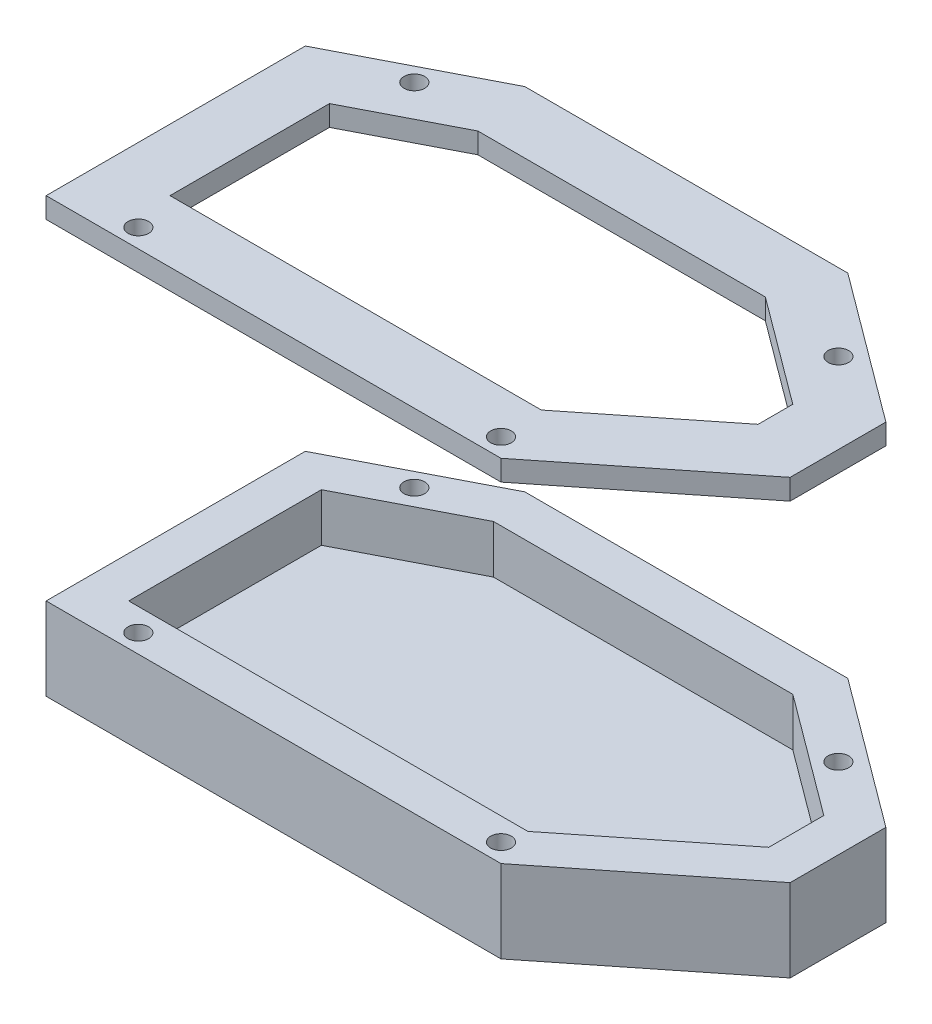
ISO-10303-21;
HEADER;
FILE_DESCRIPTION(('STEP AP214'),'2;1');
FILE_NAME('part.step','',(''),(''),'','','');
FILE_SCHEMA(('AUTOMOTIVE_DESIGN { 1 0 10303 214 1 1 1 1 }'));
ENDSEC;
DATA;
#1=APPLICATION_CONTEXT('core data for automotive mechanical design processes');
#2=APPLICATION_PROTOCOL_DEFINITION('international standard','automotive_design',2000,#1);
#3=PRODUCT_CONTEXT('',#1,'mechanical');
#4=PRODUCT('Part','Part','',(#3));
#5=PRODUCT_RELATED_PRODUCT_CATEGORY('part','',(#4));
#6=PRODUCT_DEFINITION_FORMATION('','',#4);
#7=PRODUCT_DEFINITION_CONTEXT('part definition',#1,'design');
#8=PRODUCT_DEFINITION('design','',#6,#7);
#9=PRODUCT_DEFINITION_SHAPE('','',#8);
#10=(LENGTH_UNIT() NAMED_UNIT(*) SI_UNIT(.MILLI.,.METRE.));
#11=(NAMED_UNIT(*) PLANE_ANGLE_UNIT() SI_UNIT($,.RADIAN.));
#12=(NAMED_UNIT(*) SI_UNIT($,.STERADIAN.) SOLID_ANGLE_UNIT());
#13=UNCERTAINTY_MEASURE_WITH_UNIT(LENGTH_MEASURE(1.E-05),#10,'distance_accuracy_value','');
#14=(GEOMETRIC_REPRESENTATION_CONTEXT(3) GLOBAL_UNCERTAINTY_ASSIGNED_CONTEXT((#13)) GLOBAL_UNIT_ASSIGNED_CONTEXT((#10,
#11,#12)) REPRESENTATION_CONTEXT('',''));
#15=CARTESIAN_POINT('',(0.,0.,0.));
#16=DIRECTION('',(0.,0.,1.));
#17=DIRECTION('',(1.,0.,0.));
#18=AXIS2_PLACEMENT_3D('',#15,#16,#17);
#19=CARTESIAN_POINT('',(0.,63.,0.));
#20=DIRECTION('',(0.,-1.,0.));
#21=DIRECTION('',(0.,0.,-1.));
#22=AXIS2_PLACEMENT_3D('',#19,#20,#21);
#23=PLANE('',#22);
#24=CARTESIAN_POINT('',(71.8,63.,-31.3172214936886));
#25=DIRECTION('',(0.,1.,0.));
#26=DIRECTION('',(0.,0.,1.));
#27=AXIS2_PLACEMENT_3D('',#24,#25,#26);
#28=CIRCLE('',#27,1.5);
#29=CARTESIAN_POINT('',(71.8,63.,-29.8172214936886));
#30=VERTEX_POINT('',#29);
#31=EDGE_CURVE('E214',#30,#30,#28,.T.);
#32=ORIENTED_EDGE('',*,*,#31,.F.);
#33=EDGE_LOOP('',(#32));
#34=FACE_BOUND('',#33,.T.);
#35=CARTESIAN_POINT('',(57.3941306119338,63.,3.3));
#36=DIRECTION('',(0.,1.,0.));
#37=DIRECTION('',(0.,0.,1.));
#38=AXIS2_PLACEMENT_3D('',#35,#36,#37);
#39=CIRCLE('',#38,1.5);
#40=CARTESIAN_POINT('',(57.3941306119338,63.,4.8));
#41=VERTEX_POINT('',#40);
#42=EDGE_CURVE('E220',#41,#41,#39,.T.);
#43=ORIENTED_EDGE('',*,*,#42,.F.);
#44=EDGE_LOOP('',(#43));
#45=FACE_BOUND('',#44,.T.);
#46=CARTESIAN_POINT('',(4.7,63.,3.3));
#47=DIRECTION('',(0.,1.,0.));
#48=DIRECTION('',(0.,0.,1.));
#49=AXIS2_PLACEMENT_3D('',#46,#47,#48);
#50=CIRCLE('',#49,1.5);
#51=CARTESIAN_POINT('',(4.7,63.,4.8));
#52=VERTEX_POINT('',#51);
#53=EDGE_CURVE('E226',#52,#52,#50,.T.);
#54=ORIENTED_EDGE('',*,*,#53,.F.);
#55=EDGE_LOOP('',(#54));
#56=FACE_BOUND('',#55,.T.);
#57=CARTESIAN_POINT('',(6.5,63.,-35.));
#58=DIRECTION('',(0.,1.,0.));
#59=DIRECTION('',(0.,0.,1.));
#60=AXIS2_PLACEMENT_3D('',#57,#58,#59);
#61=CIRCLE('',#60,1.5);
#62=CARTESIAN_POINT('',(6.5,63.,-33.5));
#63=VERTEX_POINT('',#62);
#64=EDGE_CURVE('E232',#63,#63,#61,.T.);
#65=ORIENTED_EDGE('',*,*,#64,.F.);
#66=EDGE_LOOP('',(#65));
#67=FACE_BOUND('',#66,.T.);
#68=DIRECTION('',(-0.888974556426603,0.,0.457956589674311));
#69=VECTOR('',#68,1.);
#70=CARTESIAN_POINT('',(15.0453803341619,63.,-42.5));
#71=LINE('',#70,#69);
#72=CARTESIAN_POINT('',(15.0453803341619,63.,-42.5));
#73=VERTEX_POINT('',#72);
#74=CARTESIAN_POINT('',(-6.,63.,-31.6584404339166));
#75=VERTEX_POINT('',#74);
#76=EDGE_CURVE('E238',#73,#75,#71,.T.);
#77=ORIENTED_EDGE('',*,*,#76,.T.);
#78=DIRECTION('',(0.,0.,1.));
#79=VECTOR('',#78,1.);
#80=CARTESIAN_POINT('',(-6.,63.,-31.6584404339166));
#81=LINE('',#80,#79);
#82=CARTESIAN_POINT('',(-6.,63.,6.));
#83=VERTEX_POINT('',#82);
#84=EDGE_CURVE('E241',#75,#83,#81,.T.);
#85=ORIENTED_EDGE('',*,*,#84,.T.);
#86=DIRECTION('',(1.,0.,0.));
#87=VECTOR('',#86,1.);
#88=CARTESIAN_POINT('',(-6.,63.,6.));
#89=LINE('',#88,#87);
#90=CARTESIAN_POINT('',(60.0941306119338,63.,6.));
#91=VERTEX_POINT('',#90);
#92=EDGE_CURVE('E244',#83,#91,#89,.T.);
#93=ORIENTED_EDGE('',*,*,#92,.T.);
#94=DIRECTION('',(0.782823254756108,0.,-0.622244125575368));
#95=VECTOR('',#94,1.);
#96=CARTESIAN_POINT('',(60.0941306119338,63.,6.));
#97=LINE('',#96,#95);
#98=CARTESIAN_POINT('',(83.5,63.,-12.604665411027));
#99=VERTEX_POINT('',#98);
#100=EDGE_CURVE('E246',#91,#99,#97,.T.);
#101=ORIENTED_EDGE('',*,*,#100,.T.);
#102=DIRECTION('',(0.,0.,-1.));
#103=VECTOR('',#102,1.);
#104=CARTESIAN_POINT('',(83.5,63.,-12.604665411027));
#105=LINE('',#104,#103);
#106=CARTESIAN_POINT('',(83.5,63.,-26.5172214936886));
#107=VERTEX_POINT('',#106);
#108=EDGE_CURVE('E248',#99,#107,#105,.T.);
#109=ORIENTED_EDGE('',*,*,#108,.T.);
#110=DIRECTION('',(-0.802743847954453,0.,-0.596324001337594));
#111=VECTOR('',#110,1.);
#112=CARTESIAN_POINT('',(83.5,63.,-26.5172214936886));
#113=LINE('',#112,#111);
#114=CARTESIAN_POINT('',(61.9847212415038,63.,-42.5));
#115=VERTEX_POINT('',#114);
#116=EDGE_CURVE('E250',#107,#115,#113,.T.);
#117=ORIENTED_EDGE('',*,*,#116,.T.);
#118=DIRECTION('',(-1.,0.,0.));
#119=VECTOR('',#118,1.);
#120=CARTESIAN_POINT('',(61.9847212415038,63.,-42.5));
#121=LINE('',#120,#119);
#122=EDGE_CURVE('E252',#115,#73,#121,.T.);
#123=ORIENTED_EDGE('',*,*,#122,.T.);
#124=EDGE_LOOP('',(#77,#85,#93,#101,#109,#117,#123));
#125=FACE_BOUND('',#124,.T.);
#126=DIRECTION('',(-0.888974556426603,0.,0.457956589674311));
#127=VECTOR('',#126,1.);
#128=CARTESIAN_POINT('',(17.227309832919,63.,-33.5));
#129=LINE('',#128,#127);
#130=CARTESIAN_POINT('',(17.227309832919,63.,-33.5));
#131=VERTEX_POINT('',#130);
#132=CARTESIAN_POINT('',(3.,63.,-26.1707797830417));
#133=VERTEX_POINT('',#132);
#134=EDGE_CURVE('E156',#131,#133,#129,.T.);
#135=ORIENTED_EDGE('',*,*,#134,.F.);
#136=DIRECTION('',(-1.,0.,0.));
#137=VECTOR('',#136,1.);
#138=CARTESIAN_POINT('',(59.0076393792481,63.,-33.5));
#139=LINE('',#138,#137);
#140=CARTESIAN_POINT('',(59.0076393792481,63.,-33.5));
#141=VERTEX_POINT('',#140);
#142=EDGE_CURVE('E187',#141,#131,#139,.T.);
#143=ORIENTED_EDGE('',*,*,#142,.F.);
#144=DIRECTION('',(-0.802743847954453,0.,-0.596324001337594));
#145=VECTOR('',#144,1.);
#146=CARTESIAN_POINT('',(74.5,63.,-21.9913892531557));
#147=LINE('',#146,#145);
#148=CARTESIAN_POINT('',(74.5,63.,-21.9913892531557));
#149=VERTEX_POINT('',#148);
#150=EDGE_CURVE('E185',#149,#141,#147,.T.);
#151=ORIENTED_EDGE('',*,*,#150,.F.);
#152=DIRECTION('',(0.,0.,-1.));
#153=VECTOR('',#152,1.);
#154=CARTESIAN_POINT('',(74.5,63.,-16.9476672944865));
#155=LINE('',#154,#153);
#156=CARTESIAN_POINT('',(74.5,63.,-16.9476672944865));
#157=VERTEX_POINT('',#156);
#158=EDGE_CURVE('E183',#157,#149,#155,.T.);
#159=ORIENTED_EDGE('',*,*,#158,.F.);
#160=DIRECTION('',(0.782823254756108,0.,-0.622244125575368));
#161=VECTOR('',#160,1.);
#162=CARTESIAN_POINT('',(56.9529346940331,63.,-3.));
#163=LINE('',#162,#161);
#164=CARTESIAN_POINT('',(56.9529346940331,63.,-3.));
#165=VERTEX_POINT('',#164);
#166=EDGE_CURVE('E179',#165,#157,#163,.T.);
#167=ORIENTED_EDGE('',*,*,#166,.F.);
#168=DIRECTION('',(1.,0.,0.));
#169=VECTOR('',#168,1.);
#170=CARTESIAN_POINT('',(3.,63.,-3.));
#171=LINE('',#170,#169);
#172=CARTESIAN_POINT('',(3.,63.,-3.));
#173=VERTEX_POINT('',#172);
#174=EDGE_CURVE('E177',#173,#165,#171,.T.);
#175=ORIENTED_EDGE('',*,*,#174,.F.);
#176=DIRECTION('',(0.,0.,1.));
#177=VECTOR('',#176,1.);
#178=CARTESIAN_POINT('',(3.,63.,-26.1707797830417));
#179=LINE('',#178,#177);
#180=EDGE_CURVE('E164',#133,#173,#179,.T.);
#181=ORIENTED_EDGE('',*,*,#180,.F.);
#182=EDGE_LOOP('',(#135,#143,#151,#159,#167,#175,#181));
#183=FACE_BOUND('',#182,.T.);
#184=ADVANCED_FACE('F55',(#34,#45,#56,#67,#125,#183),#23,.F.);
#185=CARTESIAN_POINT('',(0.,60.,0.));
#186=DIRECTION('',(0.,-1.,0.));
#187=DIRECTION('',(0.,0.,-1.));
#188=AXIS2_PLACEMENT_3D('',#185,#186,#187);
#189=PLANE('',#188);
#190=CARTESIAN_POINT('',(57.3941306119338,60.,3.3));
#191=DIRECTION('',(0.,1.,0.));
#192=DIRECTION('',(0.,0.,1.));
#193=AXIS2_PLACEMENT_3D('',#190,#191,#192);
#194=CIRCLE('',#193,1.5);
#195=CARTESIAN_POINT('',(57.3941306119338,60.,4.8));
#196=VERTEX_POINT('',#195);
#197=EDGE_CURVE('E217',#196,#196,#194,.T.);
#198=ORIENTED_EDGE('',*,*,#197,.T.);
#199=EDGE_LOOP('',(#198));
#200=FACE_BOUND('',#199,.T.);
#201=CARTESIAN_POINT('',(6.5,60.,-35.));
#202=DIRECTION('',(0.,1.,0.));
#203=DIRECTION('',(0.,0.,1.));
#204=AXIS2_PLACEMENT_3D('',#201,#202,#203);
#205=CIRCLE('',#204,1.5);
#206=CARTESIAN_POINT('',(6.5,60.,-33.5));
#207=VERTEX_POINT('',#206);
#208=EDGE_CURVE('E229',#207,#207,#205,.T.);
#209=ORIENTED_EDGE('',*,*,#208,.T.);
#210=EDGE_LOOP('',(#209));
#211=FACE_BOUND('',#210,.T.);
#212=DIRECTION('',(-0.888974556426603,0.,0.457956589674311));
#213=VECTOR('',#212,1.);
#214=CARTESIAN_POINT('',(15.0453803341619,60.,-42.5));
#215=LINE('',#214,#213);
#216=CARTESIAN_POINT('',(15.0453803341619,60.,-42.5));
#217=VERTEX_POINT('',#216);
#218=CARTESIAN_POINT('',(-6.,60.,-31.6584404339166));
#219=VERTEX_POINT('',#218);
#220=EDGE_CURVE('E235',#217,#219,#215,.T.);
#221=ORIENTED_EDGE('',*,*,#220,.F.);
#222=DIRECTION('',(-1.,0.,0.));
#223=VECTOR('',#222,1.);
#224=CARTESIAN_POINT('',(61.9847212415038,60.,-42.5));
#225=LINE('',#224,#223);
#226=CARTESIAN_POINT('',(61.9847212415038,60.,-42.5));
#227=VERTEX_POINT('',#226);
#228=EDGE_CURVE('E242',#227,#217,#225,.T.);
#229=ORIENTED_EDGE('',*,*,#228,.F.);
#230=DIRECTION('',(-0.802743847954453,0.,-0.596324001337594));
#231=VECTOR('',#230,1.);
#232=CARTESIAN_POINT('',(83.5,60.,-26.5172214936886));
#233=LINE('',#232,#231);
#234=CARTESIAN_POINT('',(83.5,60.,-26.5172214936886));
#235=VERTEX_POINT('',#234);
#236=EDGE_CURVE('E265',#235,#227,#233,.T.);
#237=ORIENTED_EDGE('',*,*,#236,.F.);
#238=DIRECTION('',(0.,0.,-1.));
#239=VECTOR('',#238,1.);
#240=CARTESIAN_POINT('',(83.5,60.,-12.604665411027));
#241=LINE('',#240,#239);
#242=CARTESIAN_POINT('',(83.5,60.,-12.604665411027));
#243=VERTEX_POINT('',#242);
#244=EDGE_CURVE('E263',#243,#235,#241,.T.);
#245=ORIENTED_EDGE('',*,*,#244,.F.);
#246=DIRECTION('',(0.782823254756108,0.,-0.622244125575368));
#247=VECTOR('',#246,1.);
#248=CARTESIAN_POINT('',(60.0941306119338,60.,6.));
#249=LINE('',#248,#247);
#250=CARTESIAN_POINT('',(60.0941306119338,60.,6.));
#251=VERTEX_POINT('',#250);
#252=EDGE_CURVE('E261',#251,#243,#249,.T.);
#253=ORIENTED_EDGE('',*,*,#252,.F.);
#254=DIRECTION('',(1.,0.,0.));
#255=VECTOR('',#254,1.);
#256=CARTESIAN_POINT('',(-6.,60.,6.));
#257=LINE('',#256,#255);
#258=CARTESIAN_POINT('',(-6.,60.,6.));
#259=VERTEX_POINT('',#258);
#260=EDGE_CURVE('E259',#259,#251,#257,.T.);
#261=ORIENTED_EDGE('',*,*,#260,.F.);
#262=DIRECTION('',(0.,0.,1.));
#263=VECTOR('',#262,1.);
#264=CARTESIAN_POINT('',(-6.,60.,-31.6584404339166));
#265=LINE('',#264,#263);
#266=EDGE_CURVE('E257',#219,#259,#265,.T.);
#267=ORIENTED_EDGE('',*,*,#266,.F.);
#268=EDGE_LOOP('',(#221,#229,#237,#245,#253,#261,#267));
#269=FACE_BOUND('',#268,.T.);
#270=CARTESIAN_POINT('',(4.7,60.,3.3));
#271=DIRECTION('',(0.,1.,0.));
#272=DIRECTION('',(0.,0.,1.));
#273=AXIS2_PLACEMENT_3D('',#270,#271,#272);
#274=CIRCLE('',#273,1.5);
#275=CARTESIAN_POINT('',(4.7,60.,4.8));
#276=VERTEX_POINT('',#275);
#277=EDGE_CURVE('E223',#276,#276,#274,.T.);
#278=ORIENTED_EDGE('',*,*,#277,.T.);
#279=EDGE_LOOP('',(#278));
#280=FACE_BOUND('',#279,.T.);
#281=CARTESIAN_POINT('',(71.8,60.,-31.3172214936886));
#282=DIRECTION('',(0.,1.,0.));
#283=DIRECTION('',(0.,0.,1.));
#284=AXIS2_PLACEMENT_3D('',#281,#282,#283);
#285=CIRCLE('',#284,1.5);
#286=CARTESIAN_POINT('',(71.8,60.,-29.8172214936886));
#287=VERTEX_POINT('',#286);
#288=EDGE_CURVE('E172',#287,#287,#285,.T.);
#289=ORIENTED_EDGE('',*,*,#288,.T.);
#290=EDGE_LOOP('',(#289));
#291=FACE_BOUND('',#290,.T.);
#292=DIRECTION('',(-1.,0.,0.));
#293=VECTOR('',#292,1.);
#294=CARTESIAN_POINT('',(59.0076393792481,60.,-33.5));
#295=LINE('',#294,#293);
#296=CARTESIAN_POINT('',(59.0076393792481,60.,-33.5));
#297=VERTEX_POINT('',#296);
#298=CARTESIAN_POINT('',(17.227309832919,60.,-33.5));
#299=VERTEX_POINT('',#298);
#300=EDGE_CURVE('E165',#297,#299,#295,.T.);
#301=ORIENTED_EDGE('',*,*,#300,.T.);
#302=DIRECTION('',(-0.888974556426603,0.,0.457956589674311));
#303=VECTOR('',#302,1.);
#304=CARTESIAN_POINT('',(17.227309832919,60.,-33.5));
#305=LINE('',#304,#303);
#306=CARTESIAN_POINT('',(3.,60.,-26.1707797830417));
#307=VERTEX_POINT('',#306);
#308=EDGE_CURVE('E78',#299,#307,#305,.T.);
#309=ORIENTED_EDGE('',*,*,#308,.T.);
#310=DIRECTION('',(0.,0.,1.));
#311=VECTOR('',#310,1.);
#312=CARTESIAN_POINT('',(3.,60.,-26.1707797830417));
#313=LINE('',#312,#311);
#314=CARTESIAN_POINT('',(3.,60.,-3.));
#315=VERTEX_POINT('',#314);
#316=EDGE_CURVE('E171',#307,#315,#313,.T.);
#317=ORIENTED_EDGE('',*,*,#316,.T.);
#318=DIRECTION('',(1.,0.,0.));
#319=VECTOR('',#318,1.);
#320=CARTESIAN_POINT('',(3.,60.,-3.));
#321=LINE('',#320,#319);
#322=CARTESIAN_POINT('',(56.9529346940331,60.,-3.));
#323=VERTEX_POINT('',#322);
#324=EDGE_CURVE('E191',#315,#323,#321,.T.);
#325=ORIENTED_EDGE('',*,*,#324,.T.);
#326=DIRECTION('',(0.782823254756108,0.,-0.622244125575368));
#327=VECTOR('',#326,1.);
#328=CARTESIAN_POINT('',(56.9529346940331,60.,-3.));
#329=LINE('',#328,#327);
#330=CARTESIAN_POINT('',(74.5,60.,-16.9476672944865));
#331=VERTEX_POINT('',#330);
#332=EDGE_CURVE('E194',#323,#331,#329,.T.);
#333=ORIENTED_EDGE('',*,*,#332,.T.);
#334=DIRECTION('',(0.,0.,-1.));
#335=VECTOR('',#334,1.);
#336=CARTESIAN_POINT('',(74.5,60.,-16.9476672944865));
#337=LINE('',#336,#335);
#338=CARTESIAN_POINT('',(74.5,60.,-21.9913892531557));
#339=VERTEX_POINT('',#338);
#340=EDGE_CURVE('E197',#331,#339,#337,.T.);
#341=ORIENTED_EDGE('',*,*,#340,.T.);
#342=DIRECTION('',(-0.802743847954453,0.,-0.596324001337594));
#343=VECTOR('',#342,1.);
#344=CARTESIAN_POINT('',(74.5,60.,-21.9913892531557));
#345=LINE('',#344,#343);
#346=EDGE_CURVE('E200',#339,#297,#345,.T.);
#347=ORIENTED_EDGE('',*,*,#346,.T.);
#348=EDGE_LOOP('',(#301,#309,#317,#325,#333,#341,#347));
#349=FACE_BOUND('',#348,.T.);
#350=ADVANCED_FACE('F292',(#200,#211,#269,#280,#291,#349),#189,.T.);
#351=CARTESIAN_POINT('',(15.0453803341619,63.,-42.5));
#352=DIRECTION('',(0.457956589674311,0.,0.888974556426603));
#353=DIRECTION('',(0.888974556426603,0.,-0.457956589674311));
#354=AXIS2_PLACEMENT_3D('',#351,#352,#353);
#355=PLANE('',#354);
#356=ORIENTED_EDGE('',*,*,#220,.T.);
#357=DIRECTION('',(0.,-1.,0.));
#358=VECTOR('',#357,1.);
#359=CARTESIAN_POINT('',(-6.,63.,-31.6584404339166));
#360=LINE('',#359,#358);
#361=EDGE_CURVE('E12',#75,#219,#360,.T.);
#362=ORIENTED_EDGE('',*,*,#361,.F.);
#363=ORIENTED_EDGE('',*,*,#76,.F.);
#364=DIRECTION('',(0.,-1.,0.));
#365=VECTOR('',#364,1.);
#366=CARTESIAN_POINT('',(15.0453803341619,63.,-42.5));
#367=LINE('',#366,#365);
#368=EDGE_CURVE('E254',#73,#217,#367,.T.);
#369=ORIENTED_EDGE('',*,*,#368,.T.);
#370=EDGE_LOOP('',(#356,#362,#363,#369));
#371=FACE_BOUND('',#370,.T.);
#372=ADVANCED_FACE('F57',(#371),#355,.F.);
#373=CARTESIAN_POINT('',(-6.,63.,-31.6584404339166));
#374=DIRECTION('',(1.,0.,0.));
#375=DIRECTION('',(0.,0.,-1.));
#376=AXIS2_PLACEMENT_3D('',#373,#374,#375);
#377=PLANE('',#376);
#378=ORIENTED_EDGE('',*,*,#266,.T.);
#379=DIRECTION('',(0.,-1.,0.));
#380=VECTOR('',#379,1.);
#381=CARTESIAN_POINT('',(-6.,63.,6.));
#382=LINE('',#381,#380);
#383=EDGE_CURVE('E63',#83,#259,#382,.T.);
#384=ORIENTED_EDGE('',*,*,#383,.F.);
#385=ORIENTED_EDGE('',*,*,#84,.F.);
#386=ORIENTED_EDGE('',*,*,#361,.T.);
#387=EDGE_LOOP('',(#378,#384,#385,#386));
#388=FACE_BOUND('',#387,.T.);
#389=ADVANCED_FACE('F309',(#388),#377,.F.);
#390=CARTESIAN_POINT('',(-6.,63.,6.));
#391=DIRECTION('',(0.,0.,-1.));
#392=DIRECTION('',(-1.,0.,0.));
#393=AXIS2_PLACEMENT_3D('',#390,#391,#392);
#394=PLANE('',#393);
#395=ORIENTED_EDGE('',*,*,#260,.T.);
#396=DIRECTION('',(0.,-1.,0.));
#397=VECTOR('',#396,1.);
#398=CARTESIAN_POINT('',(60.0941306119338,63.,6.));
#399=LINE('',#398,#397);
#400=EDGE_CURVE('E279',#91,#251,#399,.T.);
#401=ORIENTED_EDGE('',*,*,#400,.F.);
#402=ORIENTED_EDGE('',*,*,#92,.F.);
#403=ORIENTED_EDGE('',*,*,#383,.T.);
#404=EDGE_LOOP('',(#395,#401,#402,#403));
#405=FACE_BOUND('',#404,.T.);
#406=ADVANCED_FACE('F286',(#405),#394,.F.);
#407=CARTESIAN_POINT('',(60.0941306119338,63.,6.));
#408=DIRECTION('',(-0.622244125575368,0.,-0.782823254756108));
#409=DIRECTION('',(-0.782823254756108,0.,0.622244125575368));
#410=AXIS2_PLACEMENT_3D('',#407,#408,#409);
#411=PLANE('',#410);
#412=ORIENTED_EDGE('',*,*,#252,.T.);
#413=DIRECTION('',(0.,-1.,0.));
#414=VECTOR('',#413,1.);
#415=CARTESIAN_POINT('',(83.5,63.,-12.604665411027));
#416=LINE('',#415,#414);
#417=EDGE_CURVE('E276',#99,#243,#416,.T.);
#418=ORIENTED_EDGE('',*,*,#417,.F.);
#419=ORIENTED_EDGE('',*,*,#100,.F.);
#420=ORIENTED_EDGE('',*,*,#400,.T.);
#421=EDGE_LOOP('',(#412,#418,#419,#420));
#422=FACE_BOUND('',#421,.T.);
#423=ADVANCED_FACE('F298',(#422),#411,.F.);
#424=CARTESIAN_POINT('',(83.5,63.,-12.604665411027));
#425=DIRECTION('',(-1.,0.,0.));
#426=DIRECTION('',(0.,0.,1.));
#427=AXIS2_PLACEMENT_3D('',#424,#425,#426);
#428=PLANE('',#427);
#429=ORIENTED_EDGE('',*,*,#244,.T.);
#430=DIRECTION('',(0.,-1.,0.));
#431=VECTOR('',#430,1.);
#432=CARTESIAN_POINT('',(83.5,63.,-26.5172214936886));
#433=LINE('',#432,#431);
#434=EDGE_CURVE('E273',#107,#235,#433,.T.);
#435=ORIENTED_EDGE('',*,*,#434,.F.);
#436=ORIENTED_EDGE('',*,*,#108,.F.);
#437=ORIENTED_EDGE('',*,*,#417,.T.);
#438=EDGE_LOOP('',(#429,#435,#436,#437));
#439=FACE_BOUND('',#438,.T.);
#440=ADVANCED_FACE('F302',(#439),#428,.F.);
#441=CARTESIAN_POINT('',(83.5,63.,-26.5172214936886));
#442=DIRECTION('',(-0.596324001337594,0.,0.802743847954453));
#443=DIRECTION('',(0.802743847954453,0.,0.596324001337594));
#444=AXIS2_PLACEMENT_3D('',#441,#442,#443);
#445=PLANE('',#444);
#446=ORIENTED_EDGE('',*,*,#236,.T.);
#447=DIRECTION('',(0.,-1.,0.));
#448=VECTOR('',#447,1.);
#449=CARTESIAN_POINT('',(61.9847212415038,63.,-42.5));
#450=LINE('',#449,#448);
#451=EDGE_CURVE('E270',#115,#227,#450,.T.);
#452=ORIENTED_EDGE('',*,*,#451,.F.);
#453=ORIENTED_EDGE('',*,*,#116,.F.);
#454=ORIENTED_EDGE('',*,*,#434,.T.);
#455=EDGE_LOOP('',(#446,#452,#453,#454));
#456=FACE_BOUND('',#455,.T.);
#457=ADVANCED_FACE('F317',(#456),#445,.F.);
#458=CARTESIAN_POINT('',(61.9847212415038,63.,-42.5));
#459=DIRECTION('',(0.,0.,1.));
#460=DIRECTION('',(1.,0.,0.));
#461=AXIS2_PLACEMENT_3D('',#458,#459,#460);
#462=PLANE('',#461);
#463=ORIENTED_EDGE('',*,*,#228,.T.);
#464=ORIENTED_EDGE('',*,*,#368,.F.);
#465=ORIENTED_EDGE('',*,*,#122,.F.);
#466=ORIENTED_EDGE('',*,*,#451,.T.);
#467=EDGE_LOOP('',(#463,#464,#465,#466));
#468=FACE_BOUND('',#467,.T.);
#469=ADVANCED_FACE('F314',(#468),#462,.F.);
#470=CARTESIAN_POINT('',(6.5,63.,-35.));
#471=DIRECTION('',(0.,-1.,0.));
#472=DIRECTION('',(0.,0.,-1.));
#473=AXIS2_PLACEMENT_3D('',#470,#471,#472);
#474=CYLINDRICAL_SURFACE('',#473,1.5);
#475=ORIENTED_EDGE('',*,*,#64,.T.);
#476=EDGE_LOOP('',(#475));
#477=FACE_BOUND('',#476,.T.);
#478=ORIENTED_EDGE('',*,*,#208,.F.);
#479=EDGE_LOOP('',(#478));
#480=FACE_BOUND('',#479,.T.);
#481=ADVANCED_FACE('F324',(#477,#480),#474,.F.);
#482=CARTESIAN_POINT('',(4.7,63.,3.3));
#483=DIRECTION('',(0.,-1.,0.));
#484=DIRECTION('',(0.,0.,-1.));
#485=AXIS2_PLACEMENT_3D('',#482,#483,#484);
#486=CYLINDRICAL_SURFACE('',#485,1.5);
#487=ORIENTED_EDGE('',*,*,#53,.T.);
#488=EDGE_LOOP('',(#487));
#489=FACE_BOUND('',#488,.T.);
#490=ORIENTED_EDGE('',*,*,#277,.F.);
#491=EDGE_LOOP('',(#490));
#492=FACE_BOUND('',#491,.T.);
#493=ADVANCED_FACE('F340',(#489,#492),#486,.F.);
#494=CARTESIAN_POINT('',(57.3941306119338,63.,3.3));
#495=DIRECTION('',(0.,-1.,0.));
#496=DIRECTION('',(0.,0.,-1.));
#497=AXIS2_PLACEMENT_3D('',#494,#495,#496);
#498=CYLINDRICAL_SURFACE('',#497,1.5);
#499=ORIENTED_EDGE('',*,*,#42,.T.);
#500=EDGE_LOOP('',(#499));
#501=FACE_BOUND('',#500,.T.);
#502=ORIENTED_EDGE('',*,*,#197,.F.);
#503=EDGE_LOOP('',(#502));
#504=FACE_BOUND('',#503,.T.);
#505=ADVANCED_FACE('F344',(#501,#504),#498,.F.);
#506=CARTESIAN_POINT('',(71.8,63.,-31.3172214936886));
#507=DIRECTION('',(0.,-1.,0.));
#508=DIRECTION('',(0.,0.,-1.));
#509=AXIS2_PLACEMENT_3D('',#506,#507,#508);
#510=CYLINDRICAL_SURFACE('',#509,1.5);
#511=ORIENTED_EDGE('',*,*,#31,.T.);
#512=EDGE_LOOP('',(#511));
#513=FACE_BOUND('',#512,.T.);
#514=ORIENTED_EDGE('',*,*,#288,.F.);
#515=EDGE_LOOP('',(#514));
#516=FACE_BOUND('',#515,.T.);
#517=ADVANCED_FACE('F348',(#513,#516),#510,.F.);
#518=CARTESIAN_POINT('',(17.227309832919,63.,-33.5));
#519=DIRECTION('',(0.457956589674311,0.,0.888974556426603));
#520=DIRECTION('',(0.888974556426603,0.,-0.457956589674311));
#521=AXIS2_PLACEMENT_3D('',#518,#519,#520);
#522=PLANE('',#521);
#523=ORIENTED_EDGE('',*,*,#308,.F.);
#524=DIRECTION('',(0.,-1.,0.));
#525=VECTOR('',#524,1.);
#526=CARTESIAN_POINT('',(17.227309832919,63.,-33.5));
#527=LINE('',#526,#525);
#528=EDGE_CURVE('E160',#131,#299,#527,.T.);
#529=ORIENTED_EDGE('',*,*,#528,.F.);
#530=ORIENTED_EDGE('',*,*,#134,.T.);
#531=DIRECTION('',(0.,-1.,0.));
#532=VECTOR('',#531,1.);
#533=CARTESIAN_POINT('',(3.,63.,-26.1707797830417));
#534=LINE('',#533,#532);
#535=EDGE_CURVE('E159',#133,#307,#534,.T.);
#536=ORIENTED_EDGE('',*,*,#535,.T.);
#537=EDGE_LOOP('',(#523,#529,#530,#536));
#538=FACE_BOUND('',#537,.T.);
#539=ADVANCED_FACE('F158',(#538),#522,.T.);
#540=CARTESIAN_POINT('',(3.,63.,-26.1707797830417));
#541=DIRECTION('',(1.,0.,0.));
#542=DIRECTION('',(0.,0.,-1.));
#543=AXIS2_PLACEMENT_3D('',#540,#541,#542);
#544=PLANE('',#543);
#545=ORIENTED_EDGE('',*,*,#316,.F.);
#546=ORIENTED_EDGE('',*,*,#535,.F.);
#547=ORIENTED_EDGE('',*,*,#180,.T.);
#548=DIRECTION('',(0.,-1.,0.));
#549=VECTOR('',#548,1.);
#550=CARTESIAN_POINT('',(3.,63.,-3.));
#551=LINE('',#550,#549);
#552=EDGE_CURVE('E173',#173,#315,#551,.T.);
#553=ORIENTED_EDGE('',*,*,#552,.T.);
#554=EDGE_LOOP('',(#545,#546,#547,#553));
#555=FACE_BOUND('',#554,.T.);
#556=ADVANCED_FACE('F168',(#555),#544,.T.);
#557=CARTESIAN_POINT('',(3.,63.,-3.));
#558=DIRECTION('',(0.,0.,-1.));
#559=DIRECTION('',(-1.,0.,0.));
#560=AXIS2_PLACEMENT_3D('',#557,#558,#559);
#561=PLANE('',#560);
#562=ORIENTED_EDGE('',*,*,#324,.F.);
#563=ORIENTED_EDGE('',*,*,#552,.F.);
#564=ORIENTED_EDGE('',*,*,#174,.T.);
#565=DIRECTION('',(0.,-1.,0.));
#566=VECTOR('',#565,1.);
#567=CARTESIAN_POINT('',(56.9529346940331,63.,-3.));
#568=LINE('',#567,#566);
#569=EDGE_CURVE('E211',#165,#323,#568,.T.);
#570=ORIENTED_EDGE('',*,*,#569,.T.);
#571=EDGE_LOOP('',(#562,#563,#564,#570));
#572=FACE_BOUND('',#571,.T.);
#573=ADVANCED_FACE('F357',(#572),#561,.T.);
#574=CARTESIAN_POINT('',(56.9529346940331,63.,-3.));
#575=DIRECTION('',(-0.622244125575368,0.,-0.782823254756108));
#576=DIRECTION('',(-0.782823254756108,0.,0.622244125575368));
#577=AXIS2_PLACEMENT_3D('',#574,#575,#576);
#578=PLANE('',#577);
#579=ORIENTED_EDGE('',*,*,#332,.F.);
#580=ORIENTED_EDGE('',*,*,#569,.F.);
#581=ORIENTED_EDGE('',*,*,#166,.T.);
#582=DIRECTION('',(0.,-1.,0.));
#583=VECTOR('',#582,1.);
#584=CARTESIAN_POINT('',(74.5,63.,-16.9476672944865));
#585=LINE('',#584,#583);
#586=EDGE_CURVE('E209',#157,#331,#585,.T.);
#587=ORIENTED_EDGE('',*,*,#586,.T.);
#588=EDGE_LOOP('',(#579,#580,#581,#587));
#589=FACE_BOUND('',#588,.T.);
#590=ADVANCED_FACE('F360',(#589),#578,.T.);
#591=CARTESIAN_POINT('',(74.5,63.,-16.9476672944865));
#592=DIRECTION('',(-1.,0.,0.));
#593=DIRECTION('',(0.,0.,1.));
#594=AXIS2_PLACEMENT_3D('',#591,#592,#593);
#595=PLANE('',#594);
#596=ORIENTED_EDGE('',*,*,#340,.F.);
#597=ORIENTED_EDGE('',*,*,#586,.F.);
#598=ORIENTED_EDGE('',*,*,#158,.T.);
#599=DIRECTION('',(0.,-1.,0.));
#600=VECTOR('',#599,1.);
#601=CARTESIAN_POINT('',(74.5,63.,-21.9913892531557));
#602=LINE('',#601,#600);
#603=EDGE_CURVE('E207',#149,#339,#602,.T.);
#604=ORIENTED_EDGE('',*,*,#603,.T.);
#605=EDGE_LOOP('',(#596,#597,#598,#604));
#606=FACE_BOUND('',#605,.T.);
#607=ADVANCED_FACE('F364',(#606),#595,.T.);
#608=CARTESIAN_POINT('',(74.5,63.,-21.9913892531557));
#609=DIRECTION('',(-0.596324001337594,0.,0.802743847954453));
#610=DIRECTION('',(0.802743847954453,0.,0.596324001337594));
#611=AXIS2_PLACEMENT_3D('',#608,#609,#610);
#612=PLANE('',#611);
#613=ORIENTED_EDGE('',*,*,#346,.F.);
#614=ORIENTED_EDGE('',*,*,#603,.F.);
#615=ORIENTED_EDGE('',*,*,#150,.T.);
#616=DIRECTION('',(0.,-1.,0.));
#617=VECTOR('',#616,1.);
#618=CARTESIAN_POINT('',(59.0076393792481,63.,-33.5));
#619=LINE('',#618,#617);
#620=EDGE_CURVE('E70',#141,#297,#619,.T.);
#621=ORIENTED_EDGE('',*,*,#620,.T.);
#622=EDGE_LOOP('',(#613,#614,#615,#621));
#623=FACE_BOUND('',#622,.T.);
#624=ADVANCED_FACE('F368',(#623),#612,.T.);
#625=CARTESIAN_POINT('',(59.0076393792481,63.,-33.5));
#626=DIRECTION('',(0.,0.,1.));
#627=DIRECTION('',(1.,0.,0.));
#628=AXIS2_PLACEMENT_3D('',#625,#626,#627);
#629=PLANE('',#628);
#630=ORIENTED_EDGE('',*,*,#300,.F.);
#631=ORIENTED_EDGE('',*,*,#620,.F.);
#632=ORIENTED_EDGE('',*,*,#142,.T.);
#633=ORIENTED_EDGE('',*,*,#528,.T.);
#634=EDGE_LOOP('',(#630,#631,#632,#633));
#635=FACE_BOUND('',#634,.T.);
#636=ADVANCED_FACE('F372',(#635),#629,.T.);
#637=CLOSED_SHELL('',(#184,#350,#372,#389,#406,#423,#440,#457,#469,#481,#493,#505,#517,#539,
#556,#573,#590,#607,#624,#636));
#638=MANIFOLD_SOLID_BREP('B2',#637);
#639=CARTESIAN_POINT('',(0.,5.,0.));
#640=DIRECTION('',(0.,-1.,0.));
#641=DIRECTION('',(0.,0.,-1.));
#642=AXIS2_PLACEMENT_3D('',#639,#640,#641);
#643=PLANE('',#642);
#644=DIRECTION('',(1.,0.,0.));
#645=VECTOR('',#644,1.);
#646=CARTESIAN_POINT('',(58.,5.,0.));
#647=LINE('',#646,#645);
#648=CARTESIAN_POINT('',(0.,5.,0.));
#649=VERTEX_POINT('',#648);
#650=CARTESIAN_POINT('',(58.,5.,0.));
#651=VERTEX_POINT('',#650);
#652=EDGE_CURVE('E743',#649,#651,#647,.T.);
#653=ORIENTED_EDGE('',*,*,#652,.T.);
#654=DIRECTION('',(0.782823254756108,0.,-0.622244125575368));
#655=VECTOR('',#654,1.);
#656=CARTESIAN_POINT('',(77.5,5.,-15.5));
#657=LINE('',#656,#655);
#658=CARTESIAN_POINT('',(77.5,5.,-15.5));
#659=VERTEX_POINT('',#658);
#660=EDGE_CURVE('E764',#651,#659,#657,.T.);
#661=ORIENTED_EDGE('',*,*,#660,.T.);
#662=DIRECTION('',(0.,0.,-1.));
#663=VECTOR('',#662,1.);
#664=CARTESIAN_POINT('',(77.5,5.,-23.5));
#665=LINE('',#664,#663);
#666=CARTESIAN_POINT('',(77.5,5.,-23.5));
#667=VERTEX_POINT('',#666);
#668=EDGE_CURVE('E768',#659,#667,#665,.T.);
#669=ORIENTED_EDGE('',*,*,#668,.T.);
#670=DIRECTION('',(-0.802743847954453,0.,-0.596324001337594));
#671=VECTOR('',#670,1.);
#672=CARTESIAN_POINT('',(60.,5.,-36.5));
#673=LINE('',#672,#671);
#674=CARTESIAN_POINT('',(60.,5.,-36.5));
#675=VERTEX_POINT('',#674);
#676=EDGE_CURVE('E772',#667,#675,#673,.T.);
#677=ORIENTED_EDGE('',*,*,#676,.T.);
#678=DIRECTION('',(-1.,0.,0.));
#679=VECTOR('',#678,1.);
#680=CARTESIAN_POINT('',(16.5,5.,-36.5));
#681=LINE('',#680,#679);
#682=CARTESIAN_POINT('',(16.5,5.,-36.5));
#683=VERTEX_POINT('',#682);
#684=EDGE_CURVE('E776',#675,#683,#681,.T.);
#685=ORIENTED_EDGE('',*,*,#684,.T.);
#686=DIRECTION('',(-0.888974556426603,0.,0.457956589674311));
#687=VECTOR('',#686,1.);
#688=CARTESIAN_POINT('',(0.,5.,-28.));
#689=LINE('',#688,#687);
#690=CARTESIAN_POINT('',(0.,5.,-28.));
#691=VERTEX_POINT('',#690);
#692=EDGE_CURVE('E534',#683,#691,#689,.T.);
#693=ORIENTED_EDGE('',*,*,#692,.T.);
#694=DIRECTION('',(0.,0.,1.));
#695=VECTOR('',#694,1.);
#696=CARTESIAN_POINT('',(0.,5.,0.));
#697=LINE('',#696,#695);
#698=EDGE_CURVE('E53',#691,#649,#697,.T.);
#699=ORIENTED_EDGE('',*,*,#698,.T.);
#700=EDGE_LOOP('',(#653,#661,#669,#677,#685,#693,#699));
#701=FACE_BOUND('',#700,.T.);
#702=ADVANCED_FACE('F525',(#701),#643,.F.);
#703=CARTESIAN_POINT('',(16.5,0.,-36.5));
#704=DIRECTION('',(-0.457956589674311,0.,-0.888974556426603));
#705=DIRECTION('',(-0.888974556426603,0.,0.457956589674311));
#706=AXIS2_PLACEMENT_3D('',#703,#704,#705);
#707=PLANE('',#706);
#708=DIRECTION('',(0.,1.,0.));
#709=VECTOR('',#708,1.);
#710=CARTESIAN_POINT('',(0.,0.,-28.));
#711=LINE('',#710,#709);
#712=CARTESIAN_POINT('',(0.,12.,-28.));
#713=VERTEX_POINT('',#712);
#714=EDGE_CURVE('E624',#691,#713,#711,.T.);
#715=ORIENTED_EDGE('',*,*,#714,.F.);
#716=ORIENTED_EDGE('',*,*,#692,.F.);
#717=DIRECTION('',(0.,1.,0.));
#718=VECTOR('',#717,1.);
#719=CARTESIAN_POINT('',(16.5,0.,-36.5));
#720=LINE('',#719,#718);
#721=CARTESIAN_POINT('',(16.5,12.,-36.5));
#722=VERTEX_POINT('',#721);
#723=EDGE_CURVE('E636',#683,#722,#720,.T.);
#724=ORIENTED_EDGE('',*,*,#723,.T.);
#725=DIRECTION('',(-0.888974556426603,0.,0.457956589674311));
#726=VECTOR('',#725,1.);
#727=CARTESIAN_POINT('',(16.5,12.,-36.5));
#728=LINE('',#727,#726);
#729=EDGE_CURVE('E634',#722,#713,#728,.T.);
#730=ORIENTED_EDGE('',*,*,#729,.T.);
#731=EDGE_LOOP('',(#715,#716,#724,#730));
#732=FACE_BOUND('',#731,.T.);
#733=ADVANCED_FACE('F635',(#732),#707,.F.);
#734=CARTESIAN_POINT('',(60.,0.,-36.5));
#735=DIRECTION('',(0.,0.,-1.));
#736=DIRECTION('',(-1.,0.,0.));
#737=AXIS2_PLACEMENT_3D('',#734,#735,#736);
#738=PLANE('',#737);
#739=ORIENTED_EDGE('',*,*,#723,.F.);
#740=ORIENTED_EDGE('',*,*,#684,.F.);
#741=DIRECTION('',(0.,1.,0.));
#742=VECTOR('',#741,1.);
#743=CARTESIAN_POINT('',(60.,0.,-36.5));
#744=LINE('',#743,#742);
#745=CARTESIAN_POINT('',(60.,12.,-36.5));
#746=VERTEX_POINT('',#745);
#747=EDGE_CURVE('E698',#675,#746,#744,.T.);
#748=ORIENTED_EDGE('',*,*,#747,.T.);
#749=DIRECTION('',(-1.,0.,0.));
#750=VECTOR('',#749,1.);
#751=CARTESIAN_POINT('',(60.,12.,-36.5));
#752=LINE('',#751,#750);
#753=EDGE_CURVE('E665',#746,#722,#752,.T.);
#754=ORIENTED_EDGE('',*,*,#753,.T.);
#755=EDGE_LOOP('',(#739,#740,#748,#754));
#756=FACE_BOUND('',#755,.T.);
#757=ADVANCED_FACE('F783',(#756),#738,.F.);
#758=CARTESIAN_POINT('',(77.5,0.,-23.5));
#759=DIRECTION('',(0.596324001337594,0.,-0.802743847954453));
#760=DIRECTION('',(-0.802743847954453,0.,-0.596324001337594));
#761=AXIS2_PLACEMENT_3D('',#758,#759,#760);
#762=PLANE('',#761);
#763=ORIENTED_EDGE('',*,*,#747,.F.);
#764=ORIENTED_EDGE('',*,*,#676,.F.);
#765=DIRECTION('',(0.,1.,0.));
#766=VECTOR('',#765,1.);
#767=CARTESIAN_POINT('',(77.5,0.,-23.5));
#768=LINE('',#767,#766);
#769=CARTESIAN_POINT('',(77.5,12.,-23.5));
#770=VERTEX_POINT('',#769);
#771=EDGE_CURVE('E701',#667,#770,#768,.T.);
#772=ORIENTED_EDGE('',*,*,#771,.T.);
#773=DIRECTION('',(-0.802743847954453,0.,-0.596324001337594));
#774=VECTOR('',#773,1.);
#775=CARTESIAN_POINT('',(77.5,12.,-23.5));
#776=LINE('',#775,#774);
#777=EDGE_CURVE('E661',#770,#746,#776,.T.);
#778=ORIENTED_EDGE('',*,*,#777,.T.);
#779=EDGE_LOOP('',(#763,#764,#772,#778));
#780=FACE_BOUND('',#779,.T.);
#781=ADVANCED_FACE('F785',(#780),#762,.F.);
#782=CARTESIAN_POINT('',(77.5,0.,-15.5));
#783=DIRECTION('',(1.,0.,0.));
#784=DIRECTION('',(0.,0.,-1.));
#785=AXIS2_PLACEMENT_3D('',#782,#783,#784);
#786=PLANE('',#785);
#787=ORIENTED_EDGE('',*,*,#771,.F.);
#788=ORIENTED_EDGE('',*,*,#668,.F.);
#789=DIRECTION('',(0.,1.,0.));
#790=VECTOR('',#789,1.);
#791=CARTESIAN_POINT('',(77.5,0.,-15.5));
#792=LINE('',#791,#790);
#793=CARTESIAN_POINT('',(77.5,12.,-15.5));
#794=VERTEX_POINT('',#793);
#795=EDGE_CURVE('E704',#659,#794,#792,.T.);
#796=ORIENTED_EDGE('',*,*,#795,.T.);
#797=DIRECTION('',(0.,0.,-1.));
#798=VECTOR('',#797,1.);
#799=CARTESIAN_POINT('',(77.5,12.,-15.5));
#800=LINE('',#799,#798);
#801=EDGE_CURVE('E657',#794,#770,#800,.T.);
#802=ORIENTED_EDGE('',*,*,#801,.T.);
#803=EDGE_LOOP('',(#787,#788,#796,#802));
#804=FACE_BOUND('',#803,.T.);
#805=ADVANCED_FACE('F790',(#804),#786,.F.);
#806=CARTESIAN_POINT('',(58.,0.,0.));
#807=DIRECTION('',(0.622244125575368,0.,0.782823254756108));
#808=DIRECTION('',(0.782823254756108,0.,-0.622244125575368));
#809=AXIS2_PLACEMENT_3D('',#806,#807,#808);
#810=PLANE('',#809);
#811=ORIENTED_EDGE('',*,*,#795,.F.);
#812=ORIENTED_EDGE('',*,*,#660,.F.);
#813=DIRECTION('',(0.,1.,0.));
#814=VECTOR('',#813,1.);
#815=CARTESIAN_POINT('',(58.,0.,0.));
#816=LINE('',#815,#814);
#817=CARTESIAN_POINT('',(58.,12.,0.));
#818=VERTEX_POINT('',#817);
#819=EDGE_CURVE('E707',#651,#818,#816,.T.);
#820=ORIENTED_EDGE('',*,*,#819,.T.);
#821=DIRECTION('',(0.782823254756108,0.,-0.622244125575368));
#822=VECTOR('',#821,1.);
#823=CARTESIAN_POINT('',(58.,12.,0.));
#824=LINE('',#823,#822);
#825=EDGE_CURVE('E650',#818,#794,#824,.T.);
#826=ORIENTED_EDGE('',*,*,#825,.T.);
#827=EDGE_LOOP('',(#811,#812,#820,#826));
#828=FACE_BOUND('',#827,.T.);
#829=ADVANCED_FACE('F793',(#828),#810,.F.);
#830=CARTESIAN_POINT('',(0.,0.,0.));
#831=DIRECTION('',(0.,0.,1.));
#832=DIRECTION('',(1.,0.,0.));
#833=AXIS2_PLACEMENT_3D('',#830,#831,#832);
#834=PLANE('',#833);
#835=ORIENTED_EDGE('',*,*,#819,.F.);
#836=ORIENTED_EDGE('',*,*,#652,.F.);
#837=DIRECTION('',(0.,1.,0.));
#838=VECTOR('',#837,1.);
#839=CARTESIAN_POINT('',(0.,0.,0.));
#840=LINE('',#839,#838);
#841=CARTESIAN_POINT('',(0.,12.,0.));
#842=VERTEX_POINT('',#841);
#843=EDGE_CURVE('E541',#649,#842,#840,.T.);
#844=ORIENTED_EDGE('',*,*,#843,.T.);
#845=DIRECTION('',(1.,0.,0.));
#846=VECTOR('',#845,1.);
#847=CARTESIAN_POINT('',(0.,12.,0.));
#848=LINE('',#847,#846);
#849=EDGE_CURVE('E646',#842,#818,#848,.T.);
#850=ORIENTED_EDGE('',*,*,#849,.T.);
#851=EDGE_LOOP('',(#835,#836,#844,#850));
#852=FACE_BOUND('',#851,.T.);
#853=ADVANCED_FACE('F796',(#852),#834,.F.);
#854=CARTESIAN_POINT('',(0.,0.,-28.));
#855=DIRECTION('',(-1.,0.,0.));
#856=DIRECTION('',(0.,0.,1.));
#857=AXIS2_PLACEMENT_3D('',#854,#855,#856);
#858=PLANE('',#857);
#859=ORIENTED_EDGE('',*,*,#843,.F.);
#860=ORIENTED_EDGE('',*,*,#698,.F.);
#861=ORIENTED_EDGE('',*,*,#714,.T.);
#862=DIRECTION('',(0.,0.,1.));
#863=VECTOR('',#862,1.);
#864=CARTESIAN_POINT('',(0.,12.,-28.));
#865=LINE('',#864,#863);
#866=EDGE_CURVE('E628',#713,#842,#865,.T.);
#867=ORIENTED_EDGE('',*,*,#866,.T.);
#868=EDGE_LOOP('',(#859,#860,#861,#867));
#869=FACE_BOUND('',#868,.T.);
#870=ADVANCED_FACE('F626',(#869),#858,.F.);
#871=CARTESIAN_POINT('',(-6.,0.,-31.6584404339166));
#872=DIRECTION('',(-1.,0.,0.));
#873=DIRECTION('',(0.,0.,1.));
#874=AXIS2_PLACEMENT_3D('',#871,#872,#873);
#875=PLANE('',#874);
#876=DIRECTION('',(0.,1.,0.));
#877=VECTOR('',#876,1.);
#878=CARTESIAN_POINT('',(-6.,0.,6.));
#879=LINE('',#878,#877);
#880=CARTESIAN_POINT('',(-6.,0.,6.));
#881=VERTEX_POINT('',#880);
#882=CARTESIAN_POINT('',(-6.,12.,6.));
#883=VERTEX_POINT('',#882);
#884=EDGE_CURVE('E739',#881,#883,#879,.T.);
#885=ORIENTED_EDGE('',*,*,#884,.T.);
#886=DIRECTION('',(0.,0.,1.));
#887=VECTOR('',#886,1.);
#888=CARTESIAN_POINT('',(-6.,12.,-31.6584404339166));
#889=LINE('',#888,#887);
#890=CARTESIAN_POINT('',(-6.,12.,-31.6584404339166));
#891=VERTEX_POINT('',#890);
#892=EDGE_CURVE('E668',#891,#883,#889,.T.);
#893=ORIENTED_EDGE('',*,*,#892,.F.);
#894=DIRECTION('',(0.,1.,0.));
#895=VECTOR('',#894,1.);
#896=CARTESIAN_POINT('',(-6.,0.,-31.6584404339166));
#897=LINE('',#896,#895);
#898=CARTESIAN_POINT('',(-6.,0.,-31.6584404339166));
#899=VERTEX_POINT('',#898);
#900=EDGE_CURVE('E740',#899,#891,#897,.T.);
#901=ORIENTED_EDGE('',*,*,#900,.F.);
#902=DIRECTION('',(0.,0.,1.));
#903=VECTOR('',#902,1.);
#904=CARTESIAN_POINT('',(-6.,0.,-31.6584404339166));
#905=LINE('',#904,#903);
#906=EDGE_CURVE('E697',#899,#881,#905,.T.);
#907=ORIENTED_EDGE('',*,*,#906,.T.);
#908=EDGE_LOOP('',(#885,#893,#901,#907));
#909=FACE_BOUND('',#908,.T.);
#910=ADVANCED_FACE('F803',(#909),#875,.T.);
#911=CARTESIAN_POINT('',(15.0453803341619,0.,-42.5));
#912=DIRECTION('',(-0.457956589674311,0.,-0.888974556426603));
#913=DIRECTION('',(-0.888974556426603,0.,0.457956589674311));
#914=AXIS2_PLACEMENT_3D('',#911,#912,#913);
#915=PLANE('',#914);
#916=ORIENTED_EDGE('',*,*,#900,.T.);
#917=DIRECTION('',(-0.888974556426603,0.,0.457956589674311));
#918=VECTOR('',#917,1.);
#919=CARTESIAN_POINT('',(15.0453803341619,12.,-42.5));
#920=LINE('',#919,#918);
#921=CARTESIAN_POINT('',(15.0453803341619,12.,-42.5));
#922=VERTEX_POINT('',#921);
#923=EDGE_CURVE('E631',#922,#891,#920,.T.);
#924=ORIENTED_EDGE('',*,*,#923,.F.);
#925=DIRECTION('',(0.,1.,0.));
#926=VECTOR('',#925,1.);
#927=CARTESIAN_POINT('',(15.0453803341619,0.,-42.5));
#928=LINE('',#927,#926);
#929=CARTESIAN_POINT('',(15.0453803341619,0.,-42.5));
#930=VERTEX_POINT('',#929);
#931=EDGE_CURVE('E744',#930,#922,#928,.T.);
#932=ORIENTED_EDGE('',*,*,#931,.F.);
#933=DIRECTION('',(-0.888974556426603,0.,0.457956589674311));
#934=VECTOR('',#933,1.);
#935=CARTESIAN_POINT('',(15.0453803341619,0.,-42.5));
#936=LINE('',#935,#934);
#937=EDGE_CURVE('E735',#930,#899,#936,.T.);
#938=ORIENTED_EDGE('',*,*,#937,.T.);
#939=EDGE_LOOP('',(#916,#924,#932,#938));
#940=FACE_BOUND('',#939,.T.);
#941=ADVANCED_FACE('F814',(#940),#915,.T.);
#942=CARTESIAN_POINT('',(61.9847212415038,0.,-42.5));
#943=DIRECTION('',(0.,0.,-1.));
#944=DIRECTION('',(-1.,0.,0.));
#945=AXIS2_PLACEMENT_3D('',#942,#943,#944);
#946=PLANE('',#945);
#947=ORIENTED_EDGE('',*,*,#931,.T.);
#948=DIRECTION('',(-1.,0.,0.));
#949=VECTOR('',#948,1.);
#950=CARTESIAN_POINT('',(61.9847212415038,12.,-42.5));
#951=LINE('',#950,#949);
#952=CARTESIAN_POINT('',(61.9847212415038,12.,-42.5));
#953=VERTEX_POINT('',#952);
#954=EDGE_CURVE('E688',#953,#922,#951,.T.);
#955=ORIENTED_EDGE('',*,*,#954,.F.);
#956=DIRECTION('',(0.,1.,0.));
#957=VECTOR('',#956,1.);
#958=CARTESIAN_POINT('',(61.9847212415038,0.,-42.5));
#959=LINE('',#958,#957);
#960=CARTESIAN_POINT('',(61.9847212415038,0.,-42.5));
#961=VERTEX_POINT('',#960);
#962=EDGE_CURVE('E747',#961,#953,#959,.T.);
#963=ORIENTED_EDGE('',*,*,#962,.F.);
#964=DIRECTION('',(-1.,0.,0.));
#965=VECTOR('',#964,1.);
#966=CARTESIAN_POINT('',(61.9847212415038,0.,-42.5));
#967=LINE('',#966,#965);
#968=EDGE_CURVE('E731',#961,#930,#967,.T.);
#969=ORIENTED_EDGE('',*,*,#968,.T.);
#970=EDGE_LOOP('',(#947,#955,#963,#969));
#971=FACE_BOUND('',#970,.T.);
#972=ADVANCED_FACE('F831',(#971),#946,.T.);
#973=CARTESIAN_POINT('',(83.5,0.,-26.5172214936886));
#974=DIRECTION('',(0.596324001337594,0.,-0.802743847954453));
#975=DIRECTION('',(-0.802743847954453,0.,-0.596324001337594));
#976=AXIS2_PLACEMENT_3D('',#973,#974,#975);
#977=PLANE('',#976);
#978=ORIENTED_EDGE('',*,*,#962,.T.);
#979=DIRECTION('',(-0.802743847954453,0.,-0.596324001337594));
#980=VECTOR('',#979,1.);
#981=CARTESIAN_POINT('',(83.5,12.,-26.5172214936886));
#982=LINE('',#981,#980);
#983=CARTESIAN_POINT('',(83.5,12.,-26.5172214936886));
#984=VERTEX_POINT('',#983);
#985=EDGE_CURVE('E684',#984,#953,#982,.T.);
#986=ORIENTED_EDGE('',*,*,#985,.F.);
#987=DIRECTION('',(0.,1.,0.));
#988=VECTOR('',#987,1.);
#989=CARTESIAN_POINT('',(83.5,0.,-26.5172214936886));
#990=LINE('',#989,#988);
#991=CARTESIAN_POINT('',(83.5,0.,-26.5172214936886));
#992=VERTEX_POINT('',#991);
#993=EDGE_CURVE('E750',#992,#984,#990,.T.);
#994=ORIENTED_EDGE('',*,*,#993,.F.);
#995=DIRECTION('',(-0.802743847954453,0.,-0.596324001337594));
#996=VECTOR('',#995,1.);
#997=CARTESIAN_POINT('',(83.5,0.,-26.5172214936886));
#998=LINE('',#997,#996);
#999=EDGE_CURVE('E727',#992,#961,#998,.T.);
#1000=ORIENTED_EDGE('',*,*,#999,.T.);
#1001=EDGE_LOOP('',(#978,#986,#994,#1000));
#1002=FACE_BOUND('',#1001,.T.);
#1003=ADVANCED_FACE('F827',(#1002),#977,.T.);
#1004=CARTESIAN_POINT('',(83.5,0.,-12.604665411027));
#1005=DIRECTION('',(1.,0.,0.));
#1006=DIRECTION('',(0.,0.,-1.));
#1007=AXIS2_PLACEMENT_3D('',#1004,#1005,#1006);
#1008=PLANE('',#1007);
#1009=ORIENTED_EDGE('',*,*,#993,.T.);
#1010=DIRECTION('',(0.,0.,-1.));
#1011=VECTOR('',#1010,1.);
#1012=CARTESIAN_POINT('',(83.5,12.,-12.604665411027));
#1013=LINE('',#1012,#1011);
#1014=CARTESIAN_POINT('',(83.5,12.,-12.604665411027));
#1015=VERTEX_POINT('',#1014);
#1016=EDGE_CURVE('E680',#1015,#984,#1013,.T.);
#1017=ORIENTED_EDGE('',*,*,#1016,.F.);
#1018=DIRECTION('',(0.,1.,0.));
#1019=VECTOR('',#1018,1.);
#1020=CARTESIAN_POINT('',(83.5,0.,-12.604665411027));
#1021=LINE('',#1020,#1019);
#1022=CARTESIAN_POINT('',(83.5,0.,-12.604665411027));
#1023=VERTEX_POINT('',#1022);
#1024=EDGE_CURVE('E753',#1023,#1015,#1021,.T.);
#1025=ORIENTED_EDGE('',*,*,#1024,.F.);
#1026=DIRECTION('',(0.,0.,-1.));
#1027=VECTOR('',#1026,1.);
#1028=CARTESIAN_POINT('',(83.5,0.,-12.604665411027));
#1029=LINE('',#1028,#1027);
#1030=EDGE_CURVE('E723',#1023,#992,#1029,.T.);
#1031=ORIENTED_EDGE('',*,*,#1030,.T.);
#1032=EDGE_LOOP('',(#1009,#1017,#1025,#1031));
#1033=FACE_BOUND('',#1032,.T.);
#1034=ADVANCED_FACE('F823',(#1033),#1008,.T.);
#1035=CARTESIAN_POINT('',(60.0941306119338,0.,6.));
#1036=DIRECTION('',(0.622244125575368,0.,0.782823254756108));
#1037=DIRECTION('',(0.782823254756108,0.,-0.622244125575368));
#1038=AXIS2_PLACEMENT_3D('',#1035,#1036,#1037);
#1039=PLANE('',#1038);
#1040=ORIENTED_EDGE('',*,*,#1024,.T.);
#1041=DIRECTION('',(0.782823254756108,0.,-0.622244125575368));
#1042=VECTOR('',#1041,1.);
#1043=CARTESIAN_POINT('',(60.0941306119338,12.,6.));
#1044=LINE('',#1043,#1042);
#1045=CARTESIAN_POINT('',(60.0941306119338,12.,6.));
#1046=VERTEX_POINT('',#1045);
#1047=EDGE_CURVE('E676',#1046,#1015,#1044,.T.);
#1048=ORIENTED_EDGE('',*,*,#1047,.F.);
#1049=DIRECTION('',(0.,1.,0.));
#1050=VECTOR('',#1049,1.);
#1051=CARTESIAN_POINT('',(60.0941306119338,0.,6.));
#1052=LINE('',#1051,#1050);
#1053=CARTESIAN_POINT('',(60.0941306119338,0.,6.));
#1054=VERTEX_POINT('',#1053);
#1055=EDGE_CURVE('E756',#1054,#1046,#1052,.T.);
#1056=ORIENTED_EDGE('',*,*,#1055,.F.);
#1057=DIRECTION('',(0.782823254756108,0.,-0.622244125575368));
#1058=VECTOR('',#1057,1.);
#1059=CARTESIAN_POINT('',(60.0941306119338,0.,6.));
#1060=LINE('',#1059,#1058);
#1061=EDGE_CURVE('E719',#1054,#1023,#1060,.T.);
#1062=ORIENTED_EDGE('',*,*,#1061,.T.);
#1063=EDGE_LOOP('',(#1040,#1048,#1056,#1062));
#1064=FACE_BOUND('',#1063,.T.);
#1065=ADVANCED_FACE('F819',(#1064),#1039,.T.);
#1066=CARTESIAN_POINT('',(-6.,0.,6.));
#1067=DIRECTION('',(0.,0.,1.));
#1068=DIRECTION('',(1.,0.,0.));
#1069=AXIS2_PLACEMENT_3D('',#1066,#1067,#1068);
#1070=PLANE('',#1069);
#1071=ORIENTED_EDGE('',*,*,#1055,.T.);
#1072=DIRECTION('',(1.,0.,0.));
#1073=VECTOR('',#1072,1.);
#1074=CARTESIAN_POINT('',(-6.,12.,6.));
#1075=LINE('',#1074,#1073);
#1076=EDGE_CURVE('E672',#883,#1046,#1075,.T.);
#1077=ORIENTED_EDGE('',*,*,#1076,.F.);
#1078=ORIENTED_EDGE('',*,*,#884,.F.);
#1079=DIRECTION('',(1.,0.,0.));
#1080=VECTOR('',#1079,1.);
#1081=CARTESIAN_POINT('',(-6.,0.,6.));
#1082=LINE('',#1081,#1080);
#1083=EDGE_CURVE('E715',#881,#1054,#1082,.T.);
#1084=ORIENTED_EDGE('',*,*,#1083,.T.);
#1085=EDGE_LOOP('',(#1071,#1077,#1078,#1084));
#1086=FACE_BOUND('',#1085,.T.);
#1087=ADVANCED_FACE('F816',(#1086),#1070,.T.);
#1088=CARTESIAN_POINT('',(0.,12.,0.));
#1089=DIRECTION('',(0.,1.,0.));
#1090=DIRECTION('',(0.,0.,1.));
#1091=AXIS2_PLACEMENT_3D('',#1088,#1089,#1090);
#1092=PLANE('',#1091);
#1093=CARTESIAN_POINT('',(6.5,12.,-35.));
#1094=DIRECTION('',(0.,1.,0.));
#1095=DIRECTION('',(0.,0.,1.));
#1096=AXIS2_PLACEMENT_3D('',#1093,#1094,#1095);
#1097=CIRCLE('',#1096,1.5);
#1098=CARTESIAN_POINT('',(6.5,12.,-33.5));
#1099=VERTEX_POINT('',#1098);
#1100=EDGE_CURVE('E889',#1099,#1099,#1097,.T.);
#1101=ORIENTED_EDGE('',*,*,#1100,.F.);
#1102=EDGE_LOOP('',(#1101));
#1103=FACE_BOUND('',#1102,.T.);
#1104=CARTESIAN_POINT('',(57.3941306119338,12.,3.3));
#1105=DIRECTION('',(0.,1.,0.));
#1106=DIRECTION('',(0.,0.,1.));
#1107=AXIS2_PLACEMENT_3D('',#1104,#1105,#1106);
#1108=CIRCLE('',#1107,1.5);
#1109=CARTESIAN_POINT('',(57.3941306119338,12.,4.8));
#1110=VERTEX_POINT('',#1109);
#1111=EDGE_CURVE('E895',#1110,#1110,#1108,.T.);
#1112=ORIENTED_EDGE('',*,*,#1111,.F.);
#1113=EDGE_LOOP('',(#1112));
#1114=FACE_BOUND('',#1113,.T.);
#1115=CARTESIAN_POINT('',(4.7,12.,3.3));
#1116=DIRECTION('',(0.,1.,0.));
#1117=DIRECTION('',(0.,0.,1.));
#1118=AXIS2_PLACEMENT_3D('',#1115,#1116,#1117);
#1119=CIRCLE('',#1118,1.5);
#1120=CARTESIAN_POINT('',(4.7,12.,4.8));
#1121=VERTEX_POINT('',#1120);
#1122=EDGE_CURVE('E884',#1121,#1121,#1119,.T.);
#1123=ORIENTED_EDGE('',*,*,#1122,.F.);
#1124=EDGE_LOOP('',(#1123));
#1125=FACE_BOUND('',#1124,.T.);
#1126=CARTESIAN_POINT('',(71.8,12.,-31.3172214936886));
#1127=DIRECTION('',(0.,1.,0.));
#1128=DIRECTION('',(0.,0.,1.));
#1129=AXIS2_PLACEMENT_3D('',#1126,#1127,#1128);
#1130=CIRCLE('',#1129,1.5);
#1131=CARTESIAN_POINT('',(71.8,12.,-29.8172214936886));
#1132=VERTEX_POINT('',#1131);
#1133=EDGE_CURVE('E883',#1132,#1132,#1130,.T.);
#1134=ORIENTED_EDGE('',*,*,#1133,.F.);
#1135=EDGE_LOOP('',(#1134));
#1136=FACE_BOUND('',#1135,.T.);
#1137=ORIENTED_EDGE('',*,*,#892,.T.);
#1138=ORIENTED_EDGE('',*,*,#1076,.T.);
#1139=ORIENTED_EDGE('',*,*,#1047,.T.);
#1140=ORIENTED_EDGE('',*,*,#1016,.T.);
#1141=ORIENTED_EDGE('',*,*,#985,.T.);
#1142=ORIENTED_EDGE('',*,*,#954,.T.);
#1143=ORIENTED_EDGE('',*,*,#923,.T.);
#1144=EDGE_LOOP('',(#1137,#1138,#1139,#1140,#1141,#1142,#1143));
#1145=FACE_BOUND('',#1144,.T.);
#1146=ORIENTED_EDGE('',*,*,#866,.F.);
#1147=ORIENTED_EDGE('',*,*,#729,.F.);
#1148=ORIENTED_EDGE('',*,*,#753,.F.);
#1149=ORIENTED_EDGE('',*,*,#777,.F.);
#1150=ORIENTED_EDGE('',*,*,#801,.F.);
#1151=ORIENTED_EDGE('',*,*,#825,.F.);
#1152=ORIENTED_EDGE('',*,*,#849,.F.);
#1153=EDGE_LOOP('',(#1146,#1147,#1148,#1149,#1150,#1151,#1152));
#1154=FACE_BOUND('',#1153,.T.);
#1155=ADVANCED_FACE('F643',(#1103,#1114,#1125,#1136,#1145,#1154),#1092,.T.);
#1156=CARTESIAN_POINT('',(0.,0.,0.));
#1157=DIRECTION('',(0.,-1.,0.));
#1158=DIRECTION('',(0.,0.,-1.));
#1159=AXIS2_PLACEMENT_3D('',#1156,#1157,#1158);
#1160=PLANE('',#1159);
#1161=CARTESIAN_POINT('',(6.5,0.,-35.));
#1162=DIRECTION('',(0.,1.,0.));
#1163=DIRECTION('',(0.,0.,1.));
#1164=AXIS2_PLACEMENT_3D('',#1161,#1162,#1163);
#1165=CIRCLE('',#1164,1.5);
#1166=CARTESIAN_POINT('',(6.5,0.,-33.5));
#1167=VERTEX_POINT('',#1166);
#1168=EDGE_CURVE('E641',#1167,#1167,#1165,.T.);
#1169=ORIENTED_EDGE('',*,*,#1168,.T.);
#1170=EDGE_LOOP('',(#1169));
#1171=FACE_BOUND('',#1170,.T.);
#1172=CARTESIAN_POINT('',(57.3941306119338,0.,3.3));
#1173=DIRECTION('',(0.,1.,0.));
#1174=DIRECTION('',(0.,0.,1.));
#1175=AXIS2_PLACEMENT_3D('',#1172,#1173,#1174);
#1176=CIRCLE('',#1175,1.5);
#1177=CARTESIAN_POINT('',(57.3941306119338,0.,4.8));
#1178=VERTEX_POINT('',#1177);
#1179=EDGE_CURVE('E874',#1178,#1178,#1176,.T.);
#1180=ORIENTED_EDGE('',*,*,#1179,.T.);
#1181=EDGE_LOOP('',(#1180));
#1182=FACE_BOUND('',#1181,.T.);
#1183=CARTESIAN_POINT('',(4.7,0.,3.3));
#1184=DIRECTION('',(0.,1.,0.));
#1185=DIRECTION('',(0.,0.,1.));
#1186=AXIS2_PLACEMENT_3D('',#1183,#1184,#1185);
#1187=CIRCLE('',#1186,1.5);
#1188=CARTESIAN_POINT('',(4.7,0.,4.8));
#1189=VERTEX_POINT('',#1188);
#1190=EDGE_CURVE('E878',#1189,#1189,#1187,.T.);
#1191=ORIENTED_EDGE('',*,*,#1190,.T.);
#1192=EDGE_LOOP('',(#1191));
#1193=FACE_BOUND('',#1192,.T.);
#1194=CARTESIAN_POINT('',(71.8,0.,-31.3172214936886));
#1195=DIRECTION('',(0.,1.,0.));
#1196=DIRECTION('',(0.,0.,1.));
#1197=AXIS2_PLACEMENT_3D('',#1194,#1195,#1196);
#1198=CIRCLE('',#1197,1.5);
#1199=CARTESIAN_POINT('',(71.8,0.,-29.8172214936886));
#1200=VERTEX_POINT('',#1199);
#1201=EDGE_CURVE('E881',#1200,#1200,#1198,.T.);
#1202=ORIENTED_EDGE('',*,*,#1201,.T.);
#1203=EDGE_LOOP('',(#1202));
#1204=FACE_BOUND('',#1203,.T.);
#1205=ORIENTED_EDGE('',*,*,#906,.F.);
#1206=ORIENTED_EDGE('',*,*,#937,.F.);
#1207=ORIENTED_EDGE('',*,*,#968,.F.);
#1208=ORIENTED_EDGE('',*,*,#999,.F.);
#1209=ORIENTED_EDGE('',*,*,#1030,.F.);
#1210=ORIENTED_EDGE('',*,*,#1061,.F.);
#1211=ORIENTED_EDGE('',*,*,#1083,.F.);
#1212=EDGE_LOOP('',(#1205,#1206,#1207,#1208,#1209,#1210,#1211));
#1213=FACE_BOUND('',#1212,.T.);
#1214=ADVANCED_FACE('F527',(#1171,#1182,#1193,#1204,#1213),#1160,.T.);
#1215=CARTESIAN_POINT('',(71.8,0.,-31.3172214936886));
#1216=DIRECTION('',(0.,1.,0.));
#1217=DIRECTION('',(0.,0.,1.));
#1218=AXIS2_PLACEMENT_3D('',#1215,#1216,#1217);
#1219=CYLINDRICAL_SURFACE('',#1218,1.5);
#1220=ORIENTED_EDGE('',*,*,#1201,.F.);
#1221=EDGE_LOOP('',(#1220));
#1222=FACE_BOUND('',#1221,.T.);
#1223=ORIENTED_EDGE('',*,*,#1133,.T.);
#1224=EDGE_LOOP('',(#1223));
#1225=FACE_BOUND('',#1224,.T.);
#1226=ADVANCED_FACE('F857',(#1222,#1225),#1219,.F.);
#1227=CARTESIAN_POINT('',(4.7,0.,3.3));
#1228=DIRECTION('',(0.,1.,0.));
#1229=DIRECTION('',(0.,0.,1.));
#1230=AXIS2_PLACEMENT_3D('',#1227,#1228,#1229);
#1231=CYLINDRICAL_SURFACE('',#1230,1.5);
#1232=ORIENTED_EDGE('',*,*,#1190,.F.);
#1233=EDGE_LOOP('',(#1232));
#1234=FACE_BOUND('',#1233,.T.);
#1235=ORIENTED_EDGE('',*,*,#1122,.T.);
#1236=EDGE_LOOP('',(#1235));
#1237=FACE_BOUND('',#1236,.T.);
#1238=ADVANCED_FACE('F863',(#1234,#1237),#1231,.F.);
#1239=CARTESIAN_POINT('',(57.3941306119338,0.,3.3));
#1240=DIRECTION('',(0.,1.,0.));
#1241=DIRECTION('',(0.,0.,1.));
#1242=AXIS2_PLACEMENT_3D('',#1239,#1240,#1241);
#1243=CYLINDRICAL_SURFACE('',#1242,1.5);
#1244=ORIENTED_EDGE('',*,*,#1179,.F.);
#1245=EDGE_LOOP('',(#1244));
#1246=FACE_BOUND('',#1245,.T.);
#1247=ORIENTED_EDGE('',*,*,#1111,.T.);
#1248=EDGE_LOOP('',(#1247));
#1249=FACE_BOUND('',#1248,.T.);
#1250=ADVANCED_FACE('F918',(#1246,#1249),#1243,.F.);
#1251=CARTESIAN_POINT('',(6.5,0.,-35.));
#1252=DIRECTION('',(0.,1.,0.));
#1253=DIRECTION('',(0.,0.,1.));
#1254=AXIS2_PLACEMENT_3D('',#1251,#1252,#1253);
#1255=CYLINDRICAL_SURFACE('',#1254,1.5);
#1256=ORIENTED_EDGE('',*,*,#1168,.F.);
#1257=EDGE_LOOP('',(#1256));
#1258=FACE_BOUND('',#1257,.T.);
#1259=ORIENTED_EDGE('',*,*,#1100,.T.);
#1260=EDGE_LOOP('',(#1259));
#1261=FACE_BOUND('',#1260,.T.);
#1262=ADVANCED_FACE('F909',(#1258,#1261),#1255,.F.);
#1263=CLOSED_SHELL('',(#702,#733,#757,#781,#805,#829,#853,#870,#910,#941,#972,#1003,#1034,#1065,
#1087,#1155,#1214,#1226,#1238,#1250,#1262));
#1264=MANIFOLD_SOLID_BREP('B6',#1263);
#1265=ADVANCED_BREP_SHAPE_REPRESENTATION('',(#18,#638,#1264),#14);
#1266=SHAPE_DEFINITION_REPRESENTATION(#9,#1265);
ENDSEC;
END-ISO-10303-21;
